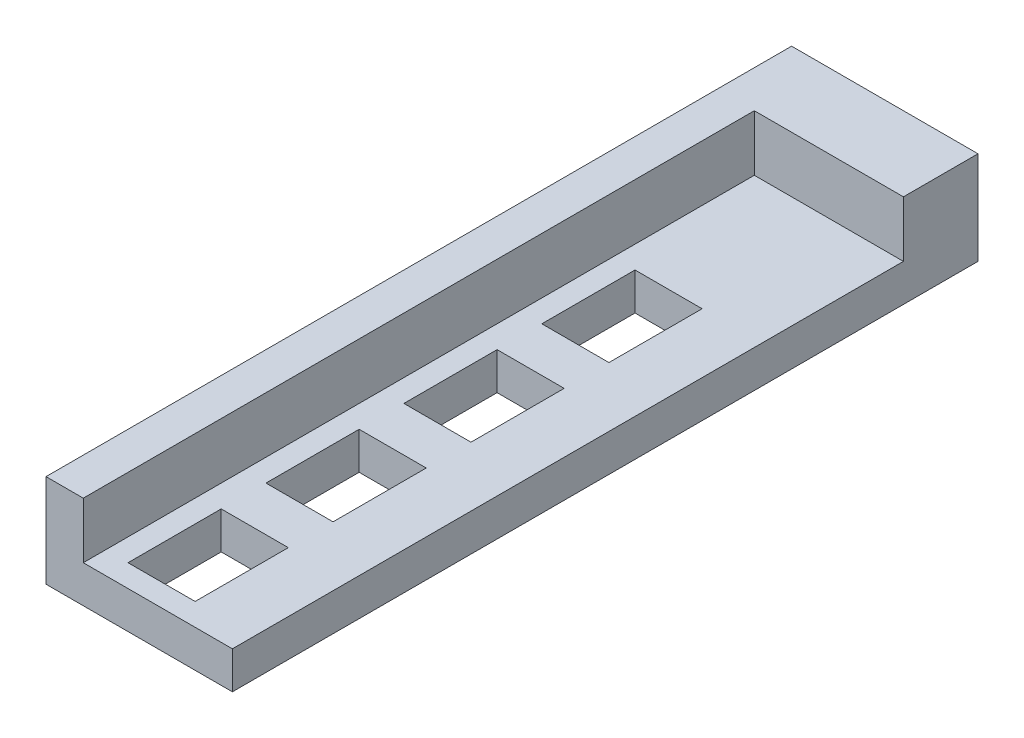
ISO-10303-21;
HEADER;
FILE_DESCRIPTION(('STEP AP214'),'2;1');
FILE_NAME('part.step','',(''),(''),'','','');
FILE_SCHEMA(('AUTOMOTIVE_DESIGN { 1 0 10303 214 1 1 1 1 }'));
ENDSEC;
DATA;
#1=APPLICATION_CONTEXT('core data for automotive mechanical design processes');
#2=APPLICATION_PROTOCOL_DEFINITION('international standard','automotive_design',2000,#1);
#3=PRODUCT_CONTEXT('',#1,'mechanical');
#4=PRODUCT('Part','Part','',(#3));
#5=PRODUCT_RELATED_PRODUCT_CATEGORY('part','',(#4));
#6=PRODUCT_DEFINITION_FORMATION('','',#4);
#7=PRODUCT_DEFINITION_CONTEXT('part definition',#1,'design');
#8=PRODUCT_DEFINITION('design','',#6,#7);
#9=PRODUCT_DEFINITION_SHAPE('','',#8);
#10=(LENGTH_UNIT() NAMED_UNIT(*) SI_UNIT(.MILLI.,.METRE.));
#11=(NAMED_UNIT(*) PLANE_ANGLE_UNIT() SI_UNIT($,.RADIAN.));
#12=(NAMED_UNIT(*) SI_UNIT($,.STERADIAN.) SOLID_ANGLE_UNIT());
#13=UNCERTAINTY_MEASURE_WITH_UNIT(LENGTH_MEASURE(1.E-05),#10,'distance_accuracy_value','');
#14=(GEOMETRIC_REPRESENTATION_CONTEXT(3) GLOBAL_UNCERTAINTY_ASSIGNED_CONTEXT((#13)) GLOBAL_UNIT_ASSIGNED_CONTEXT((#10,
#11,#12)) REPRESENTATION_CONTEXT('',''));
#15=CARTESIAN_POINT('',(0.,0.,0.));
#16=DIRECTION('',(0.,0.,1.));
#17=DIRECTION('',(1.,0.,0.));
#18=AXIS2_PLACEMENT_3D('',#15,#16,#17);
#19=CARTESIAN_POINT('',(50.,0.,200.));
#20=DIRECTION('',(-1.,0.,0.));
#21=DIRECTION('',(0.,0.,1.));
#22=AXIS2_PLACEMENT_3D('',#19,#20,#21);
#23=PLANE('',#22);
#24=DIRECTION('',(0.,1.,0.));
#25=VECTOR('',#24,1.);
#26=CARTESIAN_POINT('',(50.,0.,20.));
#27=LINE('',#26,#25);
#28=CARTESIAN_POINT('',(50.,10.,20.));
#29=VERTEX_POINT('',#28);
#30=CARTESIAN_POINT('',(50.,25.,20.));
#31=VERTEX_POINT('',#30);
#32=EDGE_CURVE('E272',#29,#31,#27,.T.);
#33=ORIENTED_EDGE('',*,*,#32,.F.);
#34=DIRECTION('',(0.,0.,-1.));
#35=VECTOR('',#34,1.);
#36=CARTESIAN_POINT('',(50.,10.,200.));
#37=LINE('',#36,#35);
#38=CARTESIAN_POINT('',(50.,10.,200.));
#39=VERTEX_POINT('',#38);
#40=EDGE_CURVE('E270',#39,#29,#37,.T.);
#41=ORIENTED_EDGE('',*,*,#40,.F.);
#42=DIRECTION('',(0.,1.,0.));
#43=VECTOR('',#42,1.);
#44=CARTESIAN_POINT('',(50.,0.,200.));
#45=LINE('',#44,#43);
#46=CARTESIAN_POINT('',(50.,0.,200.));
#47=VERTEX_POINT('',#46);
#48=EDGE_CURVE('E292',#47,#39,#45,.T.);
#49=ORIENTED_EDGE('',*,*,#48,.F.);
#50=DIRECTION('',(0.,0.,-1.));
#51=VECTOR('',#50,1.);
#52=CARTESIAN_POINT('',(50.,0.,200.));
#53=LINE('',#52,#51);
#54=CARTESIAN_POINT('',(50.,0.,0.));
#55=VERTEX_POINT('',#54);
#56=EDGE_CURVE('E310',#47,#55,#53,.T.);
#57=ORIENTED_EDGE('',*,*,#56,.T.);
#58=DIRECTION('',(0.,1.,0.));
#59=VECTOR('',#58,1.);
#60=CARTESIAN_POINT('',(50.,0.,0.));
#61=LINE('',#60,#59);
#62=CARTESIAN_POINT('',(50.,25.,0.));
#63=VERTEX_POINT('',#62);
#64=EDGE_CURVE('E302',#55,#63,#61,.T.);
#65=ORIENTED_EDGE('',*,*,#64,.T.);
#66=DIRECTION('',(0.,0.,-1.));
#67=VECTOR('',#66,1.);
#68=CARTESIAN_POINT('',(50.,25.,200.));
#69=LINE('',#68,#67);
#70=EDGE_CURVE('E308',#31,#63,#69,.T.);
#71=ORIENTED_EDGE('',*,*,#70,.F.);
#72=EDGE_LOOP('',(#33,#41,#49,#57,#65,#71));
#73=FACE_BOUND('',#72,.T.);
#74=ADVANCED_FACE('F32',(#73),#23,.F.);
#75=CARTESIAN_POINT('',(0.,25.,200.));
#76=DIRECTION('',(0.,-1.,0.));
#77=DIRECTION('',(0.,0.,-1.));
#78=AXIS2_PLACEMENT_3D('',#75,#76,#77);
#79=PLANE('',#78);
#80=DIRECTION('',(-1.,0.,0.));
#81=VECTOR('',#80,1.);
#82=CARTESIAN_POINT('',(0.,25.,20.));
#83=LINE('',#82,#81);
#84=CARTESIAN_POINT('',(10.,25.,20.));
#85=VERTEX_POINT('',#84);
#86=EDGE_CURVE('E277',#31,#85,#83,.T.);
#87=ORIENTED_EDGE('',*,*,#86,.F.);
#88=ORIENTED_EDGE('',*,*,#70,.T.);
#89=DIRECTION('',(-1.,0.,0.));
#90=VECTOR('',#89,1.);
#91=CARTESIAN_POINT('',(0.,25.,0.));
#92=LINE('',#91,#90);
#93=CARTESIAN_POINT('',(0.,25.,0.));
#94=VERTEX_POINT('',#93);
#95=EDGE_CURVE('E290',#63,#94,#92,.T.);
#96=ORIENTED_EDGE('',*,*,#95,.T.);
#97=DIRECTION('',(0.,0.,-1.));
#98=VECTOR('',#97,1.);
#99=CARTESIAN_POINT('',(0.,25.,200.));
#100=LINE('',#99,#98);
#101=CARTESIAN_POINT('',(0.,25.,200.));
#102=VERTEX_POINT('',#101);
#103=EDGE_CURVE('E297',#102,#94,#100,.T.);
#104=ORIENTED_EDGE('',*,*,#103,.F.);
#105=DIRECTION('',(-1.,0.,0.));
#106=VECTOR('',#105,1.);
#107=CARTESIAN_POINT('',(0.,25.,200.));
#108=LINE('',#107,#106);
#109=CARTESIAN_POINT('',(10.,25.,200.));
#110=VERTEX_POINT('',#109);
#111=EDGE_CURVE('E295',#110,#102,#108,.T.);
#112=ORIENTED_EDGE('',*,*,#111,.F.);
#113=DIRECTION('',(0.,0.,-1.));
#114=VECTOR('',#113,1.);
#115=CARTESIAN_POINT('',(10.,25.,200.));
#116=LINE('',#115,#114);
#117=EDGE_CURVE('E279',#110,#85,#116,.T.);
#118=ORIENTED_EDGE('',*,*,#117,.T.);
#119=EDGE_LOOP('',(#87,#88,#96,#104,#112,#118));
#120=FACE_BOUND('',#119,.T.);
#121=ADVANCED_FACE('F390',(#120),#79,.F.);
#122=CARTESIAN_POINT('',(0.,0.,200.));
#123=DIRECTION('',(0.,0.,-1.));
#124=DIRECTION('',(-1.,0.,0.));
#125=AXIS2_PLACEMENT_3D('',#122,#123,#124);
#126=PLANE('',#125);
#127=DIRECTION('',(0.,-1.,0.));
#128=VECTOR('',#127,1.);
#129=CARTESIAN_POINT('',(10.,0.,200.));
#130=LINE('',#129,#128);
#131=CARTESIAN_POINT('',(10.,10.,200.));
#132=VERTEX_POINT('',#131);
#133=EDGE_CURVE('E273',#110,#132,#130,.T.);
#134=ORIENTED_EDGE('',*,*,#133,.F.);
#135=ORIENTED_EDGE('',*,*,#111,.T.);
#136=DIRECTION('',(0.,-1.,0.));
#137=VECTOR('',#136,1.);
#138=CARTESIAN_POINT('',(0.,0.,200.));
#139=LINE('',#138,#137);
#140=CARTESIAN_POINT('',(0.,0.,200.));
#141=VERTEX_POINT('',#140);
#142=EDGE_CURVE('E286',#102,#141,#139,.T.);
#143=ORIENTED_EDGE('',*,*,#142,.T.);
#144=DIRECTION('',(1.,0.,0.));
#145=VECTOR('',#144,1.);
#146=CARTESIAN_POINT('',(0.,0.,200.));
#147=LINE('',#146,#145);
#148=EDGE_CURVE('E289',#141,#47,#147,.T.);
#149=ORIENTED_EDGE('',*,*,#148,.T.);
#150=ORIENTED_EDGE('',*,*,#48,.T.);
#151=DIRECTION('',(1.,0.,0.));
#152=VECTOR('',#151,1.);
#153=CARTESIAN_POINT('',(0.,10.,200.));
#154=LINE('',#153,#152);
#155=EDGE_CURVE('E276',#132,#39,#154,.T.);
#156=ORIENTED_EDGE('',*,*,#155,.F.);
#157=EDGE_LOOP('',(#134,#135,#143,#149,#150,#156));
#158=FACE_BOUND('',#157,.T.);
#159=ADVANCED_FACE('F396',(#158),#126,.F.);
#160=CARTESIAN_POINT('',(0.,0.,200.));
#161=DIRECTION('',(1.,0.,0.));
#162=DIRECTION('',(0.,0.,-1.));
#163=AXIS2_PLACEMENT_3D('',#160,#161,#162);
#164=PLANE('',#163);
#165=DIRECTION('',(0.,-1.,0.));
#166=VECTOR('',#165,1.);
#167=CARTESIAN_POINT('',(0.,0.,0.));
#168=LINE('',#167,#166);
#169=CARTESIAN_POINT('',(0.,0.,0.));
#170=VERTEX_POINT('',#169);
#171=EDGE_CURVE('E269',#94,#170,#168,.T.);
#172=ORIENTED_EDGE('',*,*,#171,.T.);
#173=DIRECTION('',(0.,0.,-1.));
#174=VECTOR('',#173,1.);
#175=CARTESIAN_POINT('',(0.,0.,200.));
#176=LINE('',#175,#174);
#177=EDGE_CURVE('E313',#141,#170,#176,.T.);
#178=ORIENTED_EDGE('',*,*,#177,.F.);
#179=ORIENTED_EDGE('',*,*,#142,.F.);
#180=ORIENTED_EDGE('',*,*,#103,.T.);
#181=EDGE_LOOP('',(#172,#178,#179,#180));
#182=FACE_BOUND('',#181,.T.);
#183=ADVANCED_FACE('F406',(#182),#164,.F.);
#184=CARTESIAN_POINT('',(0.,0.,200.));
#185=DIRECTION('',(0.,1.,0.));
#186=DIRECTION('',(0.,0.,1.));
#187=AXIS2_PLACEMENT_3D('',#184,#185,#186);
#188=PLANE('',#187);
#189=DIRECTION('',(-1.,0.,0.));
#190=VECTOR('',#189,1.);
#191=CARTESIAN_POINT('',(16.,0.,132.));
#192=LINE('',#191,#190);
#193=CARTESIAN_POINT('',(34.,0.,132.));
#194=VERTEX_POINT('',#193);
#195=CARTESIAN_POINT('',(16.,0.,132.));
#196=VERTEX_POINT('',#195);
#197=EDGE_CURVE('E222',#194,#196,#192,.T.);
#198=ORIENTED_EDGE('',*,*,#197,.T.);
#199=DIRECTION('',(0.,0.,1.));
#200=VECTOR('',#199,1.);
#201=CARTESIAN_POINT('',(16.,0.,157.));
#202=LINE('',#201,#200);
#203=CARTESIAN_POINT('',(16.,0.,157.));
#204=VERTEX_POINT('',#203);
#205=EDGE_CURVE('E227',#196,#204,#202,.T.);
#206=ORIENTED_EDGE('',*,*,#205,.T.);
#207=DIRECTION('',(1.,0.,0.));
#208=VECTOR('',#207,1.);
#209=CARTESIAN_POINT('',(16.,0.,157.));
#210=LINE('',#209,#208);
#211=CARTESIAN_POINT('',(34.,0.,157.));
#212=VERTEX_POINT('',#211);
#213=EDGE_CURVE('E199',#204,#212,#210,.T.);
#214=ORIENTED_EDGE('',*,*,#213,.T.);
#215=DIRECTION('',(0.,0.,-1.));
#216=VECTOR('',#215,1.);
#217=CARTESIAN_POINT('',(34.,0.,157.));
#218=LINE('',#217,#216);
#219=EDGE_CURVE('E206',#212,#194,#218,.T.);
#220=ORIENTED_EDGE('',*,*,#219,.T.);
#221=EDGE_LOOP('',(#198,#206,#214,#220));
#222=FACE_BOUND('',#221,.T.);
#223=DIRECTION('',(-1.,0.,0.));
#224=VECTOR('',#223,1.);
#225=CARTESIAN_POINT('',(16.,0.,169.));
#226=LINE('',#225,#224);
#227=CARTESIAN_POINT('',(34.,0.,169.));
#228=VERTEX_POINT('',#227);
#229=CARTESIAN_POINT('',(16.,0.,169.));
#230=VERTEX_POINT('',#229);
#231=EDGE_CURVE('E241',#228,#230,#226,.T.);
#232=ORIENTED_EDGE('',*,*,#231,.T.);
#233=DIRECTION('',(0.,0.,1.));
#234=VECTOR('',#233,1.);
#235=CARTESIAN_POINT('',(16.,0.,194.));
#236=LINE('',#235,#234);
#237=CARTESIAN_POINT('',(16.,0.,194.));
#238=VERTEX_POINT('',#237);
#239=EDGE_CURVE('E231',#230,#238,#236,.T.);
#240=ORIENTED_EDGE('',*,*,#239,.T.);
#241=DIRECTION('',(1.,0.,0.));
#242=VECTOR('',#241,1.);
#243=CARTESIAN_POINT('',(16.,0.,194.));
#244=LINE('',#243,#242);
#245=CARTESIAN_POINT('',(34.,0.,194.));
#246=VERTEX_POINT('',#245);
#247=EDGE_CURVE('E234',#238,#246,#244,.T.);
#248=ORIENTED_EDGE('',*,*,#247,.T.);
#249=DIRECTION('',(0.,0.,-1.));
#250=VECTOR('',#249,1.);
#251=CARTESIAN_POINT('',(34.,0.,194.));
#252=LINE('',#251,#250);
#253=EDGE_CURVE('E238',#246,#228,#252,.T.);
#254=ORIENTED_EDGE('',*,*,#253,.T.);
#255=EDGE_LOOP('',(#232,#240,#248,#254));
#256=FACE_BOUND('',#255,.T.);
#257=DIRECTION('',(1.,0.,0.));
#258=VECTOR('',#257,1.);
#259=CARTESIAN_POINT('',(0.,0.,0.));
#260=LINE('',#259,#258);
#261=EDGE_CURVE('E300',#170,#55,#260,.T.);
#262=ORIENTED_EDGE('',*,*,#261,.T.);
#263=ORIENTED_EDGE('',*,*,#56,.F.);
#264=ORIENTED_EDGE('',*,*,#148,.F.);
#265=ORIENTED_EDGE('',*,*,#177,.T.);
#266=EDGE_LOOP('',(#262,#263,#264,#265));
#267=FACE_BOUND('',#266,.T.);
#268=DIRECTION('',(0.,0.,1.));
#269=VECTOR('',#268,1.);
#270=CARTESIAN_POINT('',(16.,0.,120.));
#271=LINE('',#270,#269);
#272=CARTESIAN_POINT('',(16.,0.,95.));
#273=VERTEX_POINT('',#272);
#274=CARTESIAN_POINT('',(16.,0.,120.));
#275=VERTEX_POINT('',#274);
#276=EDGE_CURVE('E327',#273,#275,#271,.T.);
#277=ORIENTED_EDGE('',*,*,#276,.T.);
#278=DIRECTION('',(1.,0.,0.));
#279=VECTOR('',#278,1.);
#280=CARTESIAN_POINT('',(16.,0.,120.));
#281=LINE('',#280,#279);
#282=CARTESIAN_POINT('',(34.,0.,120.));
#283=VERTEX_POINT('',#282);
#284=EDGE_CURVE('E329',#275,#283,#281,.T.);
#285=ORIENTED_EDGE('',*,*,#284,.T.);
#286=DIRECTION('',(0.,0.,-1.));
#287=VECTOR('',#286,1.);
#288=CARTESIAN_POINT('',(34.,0.,120.));
#289=LINE('',#288,#287);
#290=CARTESIAN_POINT('',(34.,0.,95.));
#291=VERTEX_POINT('',#290);
#292=EDGE_CURVE('E331',#283,#291,#289,.T.);
#293=ORIENTED_EDGE('',*,*,#292,.T.);
#294=DIRECTION('',(-1.,0.,0.));
#295=VECTOR('',#294,1.);
#296=CARTESIAN_POINT('',(16.,0.,95.));
#297=LINE('',#296,#295);
#298=EDGE_CURVE('E333',#291,#273,#297,.T.);
#299=ORIENTED_EDGE('',*,*,#298,.T.);
#300=EDGE_LOOP('',(#277,#285,#293,#299));
#301=FACE_BOUND('',#300,.T.);
#302=DIRECTION('',(0.,0.,1.));
#303=VECTOR('',#302,1.);
#304=CARTESIAN_POINT('',(16.,0.,83.));
#305=LINE('',#304,#303);
#306=CARTESIAN_POINT('',(16.,0.,58.));
#307=VERTEX_POINT('',#306);
#308=CARTESIAN_POINT('',(16.,0.,83.));
#309=VERTEX_POINT('',#308);
#310=EDGE_CURVE('E47',#307,#309,#305,.T.);
#311=ORIENTED_EDGE('',*,*,#310,.T.);
#312=DIRECTION('',(1.,0.,0.));
#313=VECTOR('',#312,1.);
#314=CARTESIAN_POINT('',(16.,0.,83.));
#315=LINE('',#314,#313);
#316=CARTESIAN_POINT('',(34.,0.,83.));
#317=VERTEX_POINT('',#316);
#318=EDGE_CURVE('E360',#309,#317,#315,.T.);
#319=ORIENTED_EDGE('',*,*,#318,.T.);
#320=DIRECTION('',(0.,0.,-1.));
#321=VECTOR('',#320,1.);
#322=CARTESIAN_POINT('',(34.,0.,83.));
#323=LINE('',#322,#321);
#324=CARTESIAN_POINT('',(34.,0.,58.));
#325=VERTEX_POINT('',#324);
#326=EDGE_CURVE('E54',#317,#325,#323,.T.);
#327=ORIENTED_EDGE('',*,*,#326,.T.);
#328=DIRECTION('',(-1.,0.,0.));
#329=VECTOR('',#328,1.);
#330=CARTESIAN_POINT('',(16.,0.,58.));
#331=LINE('',#330,#329);
#332=EDGE_CURVE('E363',#325,#307,#331,.T.);
#333=ORIENTED_EDGE('',*,*,#332,.T.);
#334=EDGE_LOOP('',(#311,#319,#327,#333));
#335=FACE_BOUND('',#334,.T.);
#336=ADVANCED_FACE('F402',(#222,#256,#267,#301,#335),#188,.F.);
#337=CARTESIAN_POINT('',(0.,0.,0.));
#338=DIRECTION('',(0.,0.,-1.));
#339=DIRECTION('',(-1.,0.,0.));
#340=AXIS2_PLACEMENT_3D('',#337,#338,#339);
#341=PLANE('',#340);
#342=ORIENTED_EDGE('',*,*,#171,.F.);
#343=ORIENTED_EDGE('',*,*,#95,.F.);
#344=ORIENTED_EDGE('',*,*,#64,.F.);
#345=ORIENTED_EDGE('',*,*,#261,.F.);
#346=EDGE_LOOP('',(#342,#343,#344,#345));
#347=FACE_BOUND('',#346,.T.);
#348=ADVANCED_FACE('F405',(#347),#341,.T.);
#349=CARTESIAN_POINT('',(10.,0.,200.));
#350=DIRECTION('',(1.,0.,0.));
#351=DIRECTION('',(0.,0.,-1.));
#352=AXIS2_PLACEMENT_3D('',#349,#350,#351);
#353=PLANE('',#352);
#354=DIRECTION('',(0.,-1.,0.));
#355=VECTOR('',#354,1.);
#356=CARTESIAN_POINT('',(10.,0.,20.));
#357=LINE('',#356,#355);
#358=CARTESIAN_POINT('',(10.,10.,20.));
#359=VERTEX_POINT('',#358);
#360=EDGE_CURVE('E256',#85,#359,#357,.T.);
#361=ORIENTED_EDGE('',*,*,#360,.F.);
#362=ORIENTED_EDGE('',*,*,#117,.F.);
#363=ORIENTED_EDGE('',*,*,#133,.T.);
#364=DIRECTION('',(0.,0.,-1.));
#365=VECTOR('',#364,1.);
#366=CARTESIAN_POINT('',(10.,10.,200.));
#367=LINE('',#366,#365);
#368=EDGE_CURVE('E266',#132,#359,#367,.T.);
#369=ORIENTED_EDGE('',*,*,#368,.T.);
#370=EDGE_LOOP('',(#361,#362,#363,#369));
#371=FACE_BOUND('',#370,.T.);
#372=ADVANCED_FACE('F441',(#371),#353,.T.);
#373=CARTESIAN_POINT('',(0.,10.,200.));
#374=DIRECTION('',(0.,1.,0.));
#375=DIRECTION('',(0.,0.,1.));
#376=AXIS2_PLACEMENT_3D('',#373,#374,#375);
#377=PLANE('',#376);
#378=DIRECTION('',(0.,0.,1.));
#379=VECTOR('',#378,1.);
#380=CARTESIAN_POINT('',(16.,10.,157.));
#381=LINE('',#380,#379);
#382=CARTESIAN_POINT('',(16.,10.,132.));
#383=VERTEX_POINT('',#382);
#384=CARTESIAN_POINT('',(16.,10.,157.));
#385=VERTEX_POINT('',#384);
#386=EDGE_CURVE('E225',#383,#385,#381,.T.);
#387=ORIENTED_EDGE('',*,*,#386,.F.);
#388=DIRECTION('',(-1.,0.,0.));
#389=VECTOR('',#388,1.);
#390=CARTESIAN_POINT('',(16.,10.,132.));
#391=LINE('',#390,#389);
#392=CARTESIAN_POINT('',(34.,10.,132.));
#393=VERTEX_POINT('',#392);
#394=EDGE_CURVE('E211',#393,#383,#391,.T.);
#395=ORIENTED_EDGE('',*,*,#394,.F.);
#396=DIRECTION('',(0.,0.,-1.));
#397=VECTOR('',#396,1.);
#398=CARTESIAN_POINT('',(34.,10.,157.));
#399=LINE('',#398,#397);
#400=CARTESIAN_POINT('',(34.,10.,157.));
#401=VERTEX_POINT('',#400);
#402=EDGE_CURVE('E203',#401,#393,#399,.T.);
#403=ORIENTED_EDGE('',*,*,#402,.F.);
#404=DIRECTION('',(1.,0.,0.));
#405=VECTOR('',#404,1.);
#406=CARTESIAN_POINT('',(16.,10.,157.));
#407=LINE('',#406,#405);
#408=EDGE_CURVE('E189',#385,#401,#407,.T.);
#409=ORIENTED_EDGE('',*,*,#408,.F.);
#410=EDGE_LOOP('',(#387,#395,#403,#409));
#411=FACE_BOUND('',#410,.T.);
#412=DIRECTION('',(0.,0.,1.));
#413=VECTOR('',#412,1.);
#414=CARTESIAN_POINT('',(16.,10.,194.));
#415=LINE('',#414,#413);
#416=CARTESIAN_POINT('',(16.,10.,169.));
#417=VERTEX_POINT('',#416);
#418=CARTESIAN_POINT('',(16.,10.,194.));
#419=VERTEX_POINT('',#418);
#420=EDGE_CURVE('E230',#417,#419,#415,.T.);
#421=ORIENTED_EDGE('',*,*,#420,.F.);
#422=DIRECTION('',(-1.,0.,0.));
#423=VECTOR('',#422,1.);
#424=CARTESIAN_POINT('',(16.,10.,169.));
#425=LINE('',#424,#423);
#426=CARTESIAN_POINT('',(34.,10.,169.));
#427=VERTEX_POINT('',#426);
#428=EDGE_CURVE('E235',#427,#417,#425,.T.);
#429=ORIENTED_EDGE('',*,*,#428,.F.);
#430=DIRECTION('',(0.,0.,-1.));
#431=VECTOR('',#430,1.);
#432=CARTESIAN_POINT('',(34.,10.,194.));
#433=LINE('',#432,#431);
#434=CARTESIAN_POINT('',(34.,10.,194.));
#435=VERTEX_POINT('',#434);
#436=EDGE_CURVE('E249',#435,#427,#433,.T.);
#437=ORIENTED_EDGE('',*,*,#436,.F.);
#438=DIRECTION('',(1.,0.,0.));
#439=VECTOR('',#438,1.);
#440=CARTESIAN_POINT('',(16.,10.,194.));
#441=LINE('',#440,#439);
#442=EDGE_CURVE('E246',#419,#435,#441,.T.);
#443=ORIENTED_EDGE('',*,*,#442,.F.);
#444=EDGE_LOOP('',(#421,#429,#437,#443));
#445=FACE_BOUND('',#444,.T.);
#446=DIRECTION('',(1.,0.,0.));
#447=VECTOR('',#446,1.);
#448=CARTESIAN_POINT('',(0.,10.,20.));
#449=LINE('',#448,#447);
#450=EDGE_CURVE('E265',#359,#29,#449,.T.);
#451=ORIENTED_EDGE('',*,*,#450,.F.);
#452=ORIENTED_EDGE('',*,*,#368,.F.);
#453=ORIENTED_EDGE('',*,*,#155,.T.);
#454=ORIENTED_EDGE('',*,*,#40,.T.);
#455=EDGE_LOOP('',(#451,#452,#453,#454));
#456=FACE_BOUND('',#455,.T.);
#457=DIRECTION('',(0.,0.,1.));
#458=VECTOR('',#457,1.);
#459=CARTESIAN_POINT('',(16.,10.,120.));
#460=LINE('',#459,#458);
#461=CARTESIAN_POINT('',(16.,10.,95.));
#462=VERTEX_POINT('',#461);
#463=CARTESIAN_POINT('',(16.,10.,120.));
#464=VERTEX_POINT('',#463);
#465=EDGE_CURVE('E316',#462,#464,#460,.T.);
#466=ORIENTED_EDGE('',*,*,#465,.F.);
#467=DIRECTION('',(-1.,0.,0.));
#468=VECTOR('',#467,1.);
#469=CARTESIAN_POINT('',(16.,10.,95.));
#470=LINE('',#469,#468);
#471=CARTESIAN_POINT('',(34.,10.,95.));
#472=VERTEX_POINT('',#471);
#473=EDGE_CURVE('E318',#472,#462,#470,.T.);
#474=ORIENTED_EDGE('',*,*,#473,.F.);
#475=DIRECTION('',(0.,0.,-1.));
#476=VECTOR('',#475,1.);
#477=CARTESIAN_POINT('',(34.,10.,120.));
#478=LINE('',#477,#476);
#479=CARTESIAN_POINT('',(34.,10.,120.));
#480=VERTEX_POINT('',#479);
#481=EDGE_CURVE('E321',#480,#472,#478,.T.);
#482=ORIENTED_EDGE('',*,*,#481,.F.);
#483=DIRECTION('',(1.,0.,0.));
#484=VECTOR('',#483,1.);
#485=CARTESIAN_POINT('',(16.,10.,120.));
#486=LINE('',#485,#484);
#487=EDGE_CURVE('E324',#464,#480,#486,.T.);
#488=ORIENTED_EDGE('',*,*,#487,.F.);
#489=EDGE_LOOP('',(#466,#474,#482,#488));
#490=FACE_BOUND('',#489,.T.);
#491=DIRECTION('',(0.,0.,1.));
#492=VECTOR('',#491,1.);
#493=CARTESIAN_POINT('',(16.,10.,83.));
#494=LINE('',#493,#492);
#495=CARTESIAN_POINT('',(16.,10.,58.));
#496=VERTEX_POINT('',#495);
#497=CARTESIAN_POINT('',(16.,10.,83.));
#498=VERTEX_POINT('',#497);
#499=EDGE_CURVE('E348',#496,#498,#494,.T.);
#500=ORIENTED_EDGE('',*,*,#499,.F.);
#501=DIRECTION('',(-1.,0.,0.));
#502=VECTOR('',#501,1.);
#503=CARTESIAN_POINT('',(16.,10.,58.));
#504=LINE('',#503,#502);
#505=CARTESIAN_POINT('',(34.,10.,58.));
#506=VERTEX_POINT('',#505);
#507=EDGE_CURVE('E350',#506,#496,#504,.T.);
#508=ORIENTED_EDGE('',*,*,#507,.F.);
#509=DIRECTION('',(0.,0.,-1.));
#510=VECTOR('',#509,1.);
#511=CARTESIAN_POINT('',(34.,10.,83.));
#512=LINE('',#511,#510);
#513=CARTESIAN_POINT('',(34.,10.,83.));
#514=VERTEX_POINT('',#513);
#515=EDGE_CURVE('E353',#514,#506,#512,.T.);
#516=ORIENTED_EDGE('',*,*,#515,.F.);
#517=DIRECTION('',(1.,0.,0.));
#518=VECTOR('',#517,1.);
#519=CARTESIAN_POINT('',(16.,10.,83.));
#520=LINE('',#519,#518);
#521=EDGE_CURVE('E356',#498,#514,#520,.T.);
#522=ORIENTED_EDGE('',*,*,#521,.F.);
#523=EDGE_LOOP('',(#500,#508,#516,#522));
#524=FACE_BOUND('',#523,.T.);
#525=ADVANCED_FACE('F209',(#411,#445,#456,#490,#524),#377,.T.);
#526=CARTESIAN_POINT('',(0.,0.,20.));
#527=DIRECTION('',(0.,0.,-1.));
#528=DIRECTION('',(-1.,0.,0.));
#529=AXIS2_PLACEMENT_3D('',#526,#527,#528);
#530=PLANE('',#529);
#531=ORIENTED_EDGE('',*,*,#360,.T.);
#532=ORIENTED_EDGE('',*,*,#450,.T.);
#533=ORIENTED_EDGE('',*,*,#32,.T.);
#534=ORIENTED_EDGE('',*,*,#86,.T.);
#535=EDGE_LOOP('',(#531,#532,#533,#534));
#536=FACE_BOUND('',#535,.T.);
#537=ADVANCED_FACE('F440',(#536),#530,.F.);
#538=CARTESIAN_POINT('',(16.,0.,194.));
#539=DIRECTION('',(-1.,0.,0.));
#540=DIRECTION('',(0.,0.,1.));
#541=AXIS2_PLACEMENT_3D('',#538,#539,#540);
#542=PLANE('',#541);
#543=ORIENTED_EDGE('',*,*,#420,.T.);
#544=DIRECTION('',(0.,1.,0.));
#545=VECTOR('',#544,1.);
#546=CARTESIAN_POINT('',(16.,0.,194.));
#547=LINE('',#546,#545);
#548=EDGE_CURVE('E244',#238,#419,#547,.T.);
#549=ORIENTED_EDGE('',*,*,#548,.F.);
#550=ORIENTED_EDGE('',*,*,#239,.F.);
#551=DIRECTION('',(0.,1.,0.));
#552=VECTOR('',#551,1.);
#553=CARTESIAN_POINT('',(16.,0.,169.));
#554=LINE('',#553,#552);
#555=EDGE_CURVE('E254',#230,#417,#554,.T.);
#556=ORIENTED_EDGE('',*,*,#555,.T.);
#557=EDGE_LOOP('',(#543,#549,#550,#556));
#558=FACE_BOUND('',#557,.T.);
#559=ADVANCED_FACE('F447',(#558),#542,.F.);
#560=CARTESIAN_POINT('',(16.,0.,169.));
#561=DIRECTION('',(0.,0.,-1.));
#562=DIRECTION('',(-1.,0.,0.));
#563=AXIS2_PLACEMENT_3D('',#560,#561,#562);
#564=PLANE('',#563);
#565=ORIENTED_EDGE('',*,*,#428,.T.);
#566=ORIENTED_EDGE('',*,*,#555,.F.);
#567=ORIENTED_EDGE('',*,*,#231,.F.);
#568=DIRECTION('',(0.,1.,0.));
#569=VECTOR('',#568,1.);
#570=CARTESIAN_POINT('',(34.,0.,169.));
#571=LINE('',#570,#569);
#572=EDGE_CURVE('E257',#228,#427,#571,.T.);
#573=ORIENTED_EDGE('',*,*,#572,.T.);
#574=EDGE_LOOP('',(#565,#566,#567,#573));
#575=FACE_BOUND('',#574,.T.);
#576=ADVANCED_FACE('F505',(#575),#564,.F.);
#577=CARTESIAN_POINT('',(34.,0.,194.));
#578=DIRECTION('',(1.,0.,0.));
#579=DIRECTION('',(0.,0.,-1.));
#580=AXIS2_PLACEMENT_3D('',#577,#578,#579);
#581=PLANE('',#580);
#582=ORIENTED_EDGE('',*,*,#436,.T.);
#583=ORIENTED_EDGE('',*,*,#572,.F.);
#584=ORIENTED_EDGE('',*,*,#253,.F.);
#585=DIRECTION('',(0.,1.,0.));
#586=VECTOR('',#585,1.);
#587=CARTESIAN_POINT('',(34.,0.,194.));
#588=LINE('',#587,#586);
#589=EDGE_CURVE('E259',#246,#435,#588,.T.);
#590=ORIENTED_EDGE('',*,*,#589,.T.);
#591=EDGE_LOOP('',(#582,#583,#584,#590));
#592=FACE_BOUND('',#591,.T.);
#593=ADVANCED_FACE('F514',(#592),#581,.F.);
#594=CARTESIAN_POINT('',(16.,0.,194.));
#595=DIRECTION('',(0.,0.,1.));
#596=DIRECTION('',(1.,0.,0.));
#597=AXIS2_PLACEMENT_3D('',#594,#595,#596);
#598=PLANE('',#597);
#599=ORIENTED_EDGE('',*,*,#442,.T.);
#600=ORIENTED_EDGE('',*,*,#589,.F.);
#601=ORIENTED_EDGE('',*,*,#247,.F.);
#602=ORIENTED_EDGE('',*,*,#548,.T.);
#603=EDGE_LOOP('',(#599,#600,#601,#602));
#604=FACE_BOUND('',#603,.T.);
#605=ADVANCED_FACE('F524',(#604),#598,.F.);
#606=CARTESIAN_POINT('',(16.,0.,157.));
#607=DIRECTION('',(-1.,0.,0.));
#608=DIRECTION('',(0.,0.,1.));
#609=AXIS2_PLACEMENT_3D('',#606,#607,#608);
#610=PLANE('',#609);
#611=ORIENTED_EDGE('',*,*,#386,.T.);
#612=DIRECTION('',(0.,1.,0.));
#613=VECTOR('',#612,1.);
#614=CARTESIAN_POINT('',(16.,0.,157.));
#615=LINE('',#614,#613);
#616=EDGE_CURVE('E195',#204,#385,#615,.T.);
#617=ORIENTED_EDGE('',*,*,#616,.F.);
#618=ORIENTED_EDGE('',*,*,#205,.F.);
#619=DIRECTION('',(0.,1.,0.));
#620=VECTOR('',#619,1.);
#621=CARTESIAN_POINT('',(16.,0.,132.));
#622=LINE('',#621,#620);
#623=EDGE_CURVE('E219',#196,#383,#622,.T.);
#624=ORIENTED_EDGE('',*,*,#623,.T.);
#625=EDGE_LOOP('',(#611,#617,#618,#624));
#626=FACE_BOUND('',#625,.T.);
#627=ADVANCED_FACE('F533',(#626),#610,.F.);
#628=CARTESIAN_POINT('',(16.,0.,132.));
#629=DIRECTION('',(0.,0.,-1.));
#630=DIRECTION('',(-1.,0.,0.));
#631=AXIS2_PLACEMENT_3D('',#628,#629,#630);
#632=PLANE('',#631);
#633=ORIENTED_EDGE('',*,*,#394,.T.);
#634=ORIENTED_EDGE('',*,*,#623,.F.);
#635=ORIENTED_EDGE('',*,*,#197,.F.);
#636=DIRECTION('',(0.,1.,0.));
#637=VECTOR('',#636,1.);
#638=CARTESIAN_POINT('',(34.,0.,132.));
#639=LINE('',#638,#637);
#640=EDGE_CURVE('E212',#194,#393,#639,.T.);
#641=ORIENTED_EDGE('',*,*,#640,.T.);
#642=EDGE_LOOP('',(#633,#634,#635,#641));
#643=FACE_BOUND('',#642,.T.);
#644=ADVANCED_FACE('F552',(#643),#632,.F.);
#645=CARTESIAN_POINT('',(34.,0.,157.));
#646=DIRECTION('',(1.,0.,0.));
#647=DIRECTION('',(0.,0.,-1.));
#648=AXIS2_PLACEMENT_3D('',#645,#646,#647);
#649=PLANE('',#648);
#650=ORIENTED_EDGE('',*,*,#402,.T.);
#651=ORIENTED_EDGE('',*,*,#640,.F.);
#652=ORIENTED_EDGE('',*,*,#219,.F.);
#653=DIRECTION('',(0.,1.,0.));
#654=VECTOR('',#653,1.);
#655=CARTESIAN_POINT('',(34.,0.,157.));
#656=LINE('',#655,#654);
#657=EDGE_CURVE('E192',#212,#401,#656,.T.);
#658=ORIENTED_EDGE('',*,*,#657,.T.);
#659=EDGE_LOOP('',(#650,#651,#652,#658));
#660=FACE_BOUND('',#659,.T.);
#661=ADVANCED_FACE('F202',(#660),#649,.F.);
#662=CARTESIAN_POINT('',(16.,0.,157.));
#663=DIRECTION('',(0.,0.,1.));
#664=DIRECTION('',(1.,0.,0.));
#665=AXIS2_PLACEMENT_3D('',#662,#663,#664);
#666=PLANE('',#665);
#667=ORIENTED_EDGE('',*,*,#408,.T.);
#668=ORIENTED_EDGE('',*,*,#657,.F.);
#669=ORIENTED_EDGE('',*,*,#213,.F.);
#670=ORIENTED_EDGE('',*,*,#616,.T.);
#671=EDGE_LOOP('',(#667,#668,#669,#670));
#672=FACE_BOUND('',#671,.T.);
#673=ADVANCED_FACE('F191',(#672),#666,.F.);
#674=CARTESIAN_POINT('',(16.,0.,120.));
#675=DIRECTION('',(0.,0.,1.));
#676=DIRECTION('',(1.,0.,0.));
#677=AXIS2_PLACEMENT_3D('',#674,#675,#676);
#678=PLANE('',#677);
#679=ORIENTED_EDGE('',*,*,#487,.T.);
#680=DIRECTION('',(0.,1.,0.));
#681=VECTOR('',#680,1.);
#682=CARTESIAN_POINT('',(34.,0.,120.));
#683=LINE('',#682,#681);
#684=EDGE_CURVE('E345',#283,#480,#683,.T.);
#685=ORIENTED_EDGE('',*,*,#684,.F.);
#686=ORIENTED_EDGE('',*,*,#284,.F.);
#687=DIRECTION('',(0.,1.,0.));
#688=VECTOR('',#687,1.);
#689=CARTESIAN_POINT('',(16.,0.,120.));
#690=LINE('',#689,#688);
#691=EDGE_CURVE('E336',#275,#464,#690,.T.);
#692=ORIENTED_EDGE('',*,*,#691,.T.);
#693=EDGE_LOOP('',(#679,#685,#686,#692));
#694=FACE_BOUND('',#693,.T.);
#695=ADVANCED_FACE('F421',(#694),#678,.F.);
#696=CARTESIAN_POINT('',(34.,0.,120.));
#697=DIRECTION('',(1.,0.,0.));
#698=DIRECTION('',(0.,0.,-1.));
#699=AXIS2_PLACEMENT_3D('',#696,#697,#698);
#700=PLANE('',#699);
#701=ORIENTED_EDGE('',*,*,#481,.T.);
#702=DIRECTION('',(0.,1.,0.));
#703=VECTOR('',#702,1.);
#704=CARTESIAN_POINT('',(34.,0.,95.));
#705=LINE('',#704,#703);
#706=EDGE_CURVE('E342',#291,#472,#705,.T.);
#707=ORIENTED_EDGE('',*,*,#706,.F.);
#708=ORIENTED_EDGE('',*,*,#292,.F.);
#709=ORIENTED_EDGE('',*,*,#684,.T.);
#710=EDGE_LOOP('',(#701,#707,#708,#709));
#711=FACE_BOUND('',#710,.T.);
#712=ADVANCED_FACE('F418',(#711),#700,.F.);
#713=CARTESIAN_POINT('',(16.,0.,95.));
#714=DIRECTION('',(0.,0.,-1.));
#715=DIRECTION('',(-1.,0.,0.));
#716=AXIS2_PLACEMENT_3D('',#713,#714,#715);
#717=PLANE('',#716);
#718=ORIENTED_EDGE('',*,*,#473,.T.);
#719=DIRECTION('',(0.,1.,0.));
#720=VECTOR('',#719,1.);
#721=CARTESIAN_POINT('',(16.,0.,95.));
#722=LINE('',#721,#720);
#723=EDGE_CURVE('E339',#273,#462,#722,.T.);
#724=ORIENTED_EDGE('',*,*,#723,.F.);
#725=ORIENTED_EDGE('',*,*,#298,.F.);
#726=ORIENTED_EDGE('',*,*,#706,.T.);
#727=EDGE_LOOP('',(#718,#724,#725,#726));
#728=FACE_BOUND('',#727,.T.);
#729=ADVANCED_FACE('F414',(#728),#717,.F.);
#730=CARTESIAN_POINT('',(16.,0.,120.));
#731=DIRECTION('',(-1.,0.,0.));
#732=DIRECTION('',(0.,0.,1.));
#733=AXIS2_PLACEMENT_3D('',#730,#731,#732);
#734=PLANE('',#733);
#735=ORIENTED_EDGE('',*,*,#465,.T.);
#736=ORIENTED_EDGE('',*,*,#691,.F.);
#737=ORIENTED_EDGE('',*,*,#276,.F.);
#738=ORIENTED_EDGE('',*,*,#723,.T.);
#739=EDGE_LOOP('',(#735,#736,#737,#738));
#740=FACE_BOUND('',#739,.T.);
#741=ADVANCED_FACE('F411',(#740),#734,.F.);
#742=CARTESIAN_POINT('',(16.,0.,83.));
#743=DIRECTION('',(0.,0.,1.));
#744=DIRECTION('',(1.,0.,0.));
#745=AXIS2_PLACEMENT_3D('',#742,#743,#744);
#746=PLANE('',#745);
#747=ORIENTED_EDGE('',*,*,#521,.T.);
#748=DIRECTION('',(0.,1.,0.));
#749=VECTOR('',#748,1.);
#750=CARTESIAN_POINT('',(34.,0.,83.));
#751=LINE('',#750,#749);
#752=EDGE_CURVE('E11',#317,#514,#751,.T.);
#753=ORIENTED_EDGE('',*,*,#752,.F.);
#754=ORIENTED_EDGE('',*,*,#318,.F.);
#755=DIRECTION('',(0.,1.,0.));
#756=VECTOR('',#755,1.);
#757=CARTESIAN_POINT('',(16.,0.,83.));
#758=LINE('',#757,#756);
#759=EDGE_CURVE('E365',#309,#498,#758,.T.);
#760=ORIENTED_EDGE('',*,*,#759,.T.);
#761=EDGE_LOOP('',(#747,#753,#754,#760));
#762=FACE_BOUND('',#761,.T.);
#763=ADVANCED_FACE('F34',(#762),#746,.F.);
#764=CARTESIAN_POINT('',(34.,0.,83.));
#765=DIRECTION('',(1.,0.,0.));
#766=DIRECTION('',(0.,0.,-1.));
#767=AXIS2_PLACEMENT_3D('',#764,#765,#766);
#768=PLANE('',#767);
#769=ORIENTED_EDGE('',*,*,#515,.T.);
#770=DIRECTION('',(0.,1.,0.));
#771=VECTOR('',#770,1.);
#772=CARTESIAN_POINT('',(34.,0.,58.));
#773=LINE('',#772,#771);
#774=EDGE_CURVE('E40',#325,#506,#773,.T.);
#775=ORIENTED_EDGE('',*,*,#774,.F.);
#776=ORIENTED_EDGE('',*,*,#326,.F.);
#777=ORIENTED_EDGE('',*,*,#752,.T.);
#778=EDGE_LOOP('',(#769,#775,#776,#777));
#779=FACE_BOUND('',#778,.T.);
#780=ADVANCED_FACE('F375',(#779),#768,.F.);
#781=CARTESIAN_POINT('',(16.,0.,58.));
#782=DIRECTION('',(0.,0.,-1.));
#783=DIRECTION('',(-1.,0.,0.));
#784=AXIS2_PLACEMENT_3D('',#781,#782,#783);
#785=PLANE('',#784);
#786=ORIENTED_EDGE('',*,*,#507,.T.);
#787=DIRECTION('',(0.,1.,0.));
#788=VECTOR('',#787,1.);
#789=CARTESIAN_POINT('',(16.,0.,58.));
#790=LINE('',#789,#788);
#791=EDGE_CURVE('E368',#307,#496,#790,.T.);
#792=ORIENTED_EDGE('',*,*,#791,.F.);
#793=ORIENTED_EDGE('',*,*,#332,.F.);
#794=ORIENTED_EDGE('',*,*,#774,.T.);
#795=EDGE_LOOP('',(#786,#792,#793,#794));
#796=FACE_BOUND('',#795,.T.);
#797=ADVANCED_FACE('F372',(#796),#785,.F.);
#798=CARTESIAN_POINT('',(16.,0.,83.));
#799=DIRECTION('',(-1.,0.,0.));
#800=DIRECTION('',(0.,0.,1.));
#801=AXIS2_PLACEMENT_3D('',#798,#799,#800);
#802=PLANE('',#801);
#803=ORIENTED_EDGE('',*,*,#499,.T.);
#804=ORIENTED_EDGE('',*,*,#759,.F.);
#805=ORIENTED_EDGE('',*,*,#310,.F.);
#806=ORIENTED_EDGE('',*,*,#791,.T.);
#807=EDGE_LOOP('',(#803,#804,#805,#806));
#808=FACE_BOUND('',#807,.T.);
#809=ADVANCED_FACE('F381',(#808),#802,.F.);
#810=CLOSED_SHELL('',(#74,#121,#159,#183,#336,#348,#372,#525,#537,#559,#576,#593,#605,#627,#644,
#661,#673,#695,#712,#729,#741,#763,#780,#797,#809));
#811=MANIFOLD_SOLID_BREP('B2',#810);
#812=ADVANCED_BREP_SHAPE_REPRESENTATION('',(#18,#811),#14);
#813=SHAPE_DEFINITION_REPRESENTATION(#9,#812);
ENDSEC;
END-ISO-10303-21;
